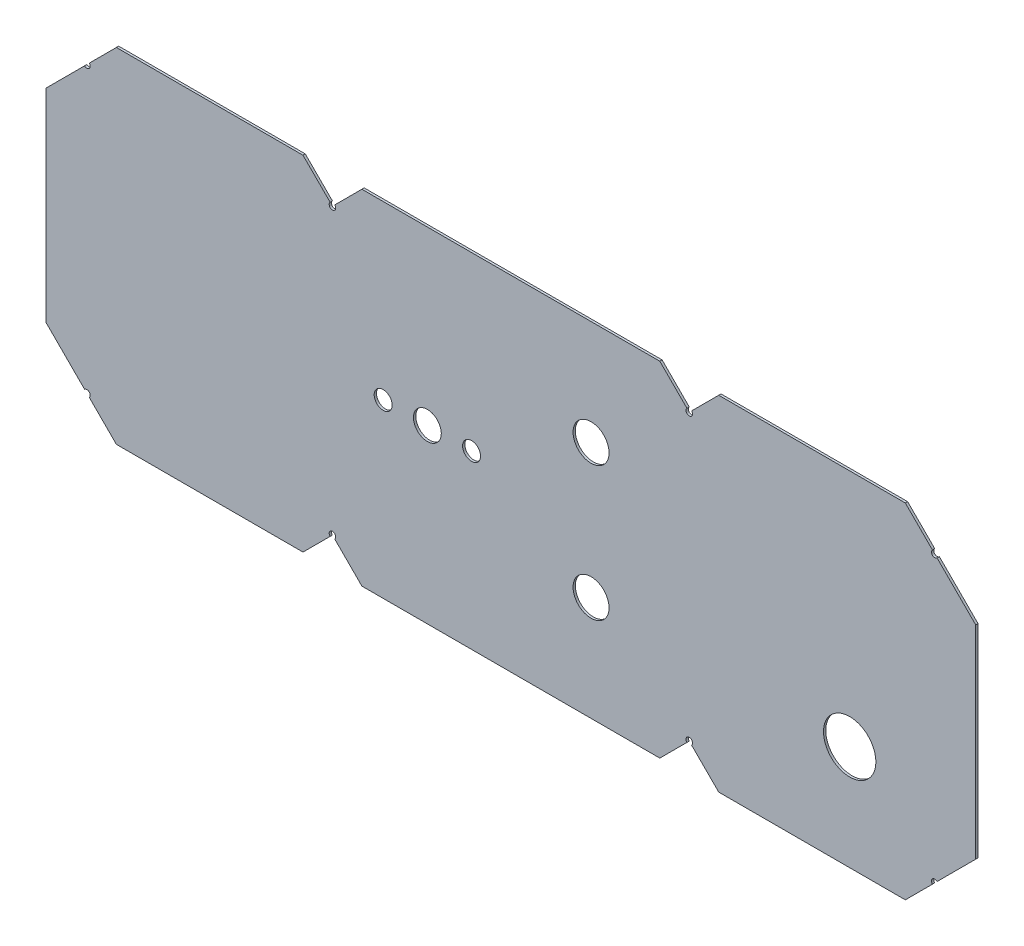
from build123d import *

# Parameters (mm, degrees)
IZIM1_R                     = 8
IZIM1_R_2                   = 2.75
IZIM1_R_3                   = 5.5
IZIM1_R_4                   = 4.25
Y_KSEKLIK_EKSTR_ZYON1_DEPTH = 0.7


with BuildPart() as part:
    # izim1 → Y_kseklik-Ekstr_zyon1 (new body)
    with BuildSketch(Plane.XY):
        with BuildLine():
            Line((10.439339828, 94.939339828), (10.792893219, 95.292893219))
            ThreePointArc((10.792893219, 95.292893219), (12.207106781, 95.292893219), (12.207106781, 96.707106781))
            Line((12.207106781, 96.707106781), (12.560660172, 97.060660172))
            Line((12.560660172, 97.060660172), (20.5, 105))
            Line((20.5, 105), (77.5, 105))
            Line((77.5, 105), (85.439339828, 97.060660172))
            Line((85.439339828, 97.060660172), (85.792893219, 96.707106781))
            ThreePointArc((85.792893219, 96.707106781), (86.5, 95), (87.207106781, 96.707106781))
            Line((87.207106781, 96.707106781), (87.560660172, 97.060660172))
            Line((87.560660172, 97.060660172), (95.5, 105))
            Line((95.5, 105), (132, 105))
            Line((132, 105), (150, 105))
            Line((150, 105), (186.5, 105))
            Line((186.5, 105), (194.439339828, 97.060660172))
            Line((194.439339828, 97.060660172), (194.792893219, 96.707106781))
            ThreePointArc((194.792893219, 96.707106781), (195.5, 95), (196.207106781, 96.707106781))
            Line((196.207106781, 96.707106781), (196.560660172, 97.060660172))
            Line((196.560660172, 97.060660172), (204.5, 105))
            Line((204.5, 105), (261.5, 105))
            Line((261.5, 105), (269.439339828, 97.060660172))
            Line((269.439339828, 97.060660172), (269.792893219, 96.707106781))
            ThreePointArc((269.792893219, 96.707106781), (269.792893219, 95.292893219), (271.207106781, 95.292893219))
            Line((271.207106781, 95.292893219), (271.560660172, 94.939339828))
            Line((271.560660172, 94.939339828), (282, 84.5))
            Line((282, 84.5), (283, 83.5))
            Line((283, 83.5), (283, 21.5))
            Line((283, 21.5), (282, 20.5))
            Line((282, 20.5), (271.560660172, 10.060660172))
            Line((271.560660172, 10.060660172), (271.207106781, 9.707106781))
            ThreePointArc((271.207106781, 9.707106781), (269.792893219, 9.707106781), (269.792893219, 8.292893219))
            Line((269.792893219, 8.292893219), (269.439339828, 7.939339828))
            Line((269.439339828, 7.939339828), (261.5, 0))
            Line((261.5, 0), (204.5, 0))
            Line((204.5, 0), (196.560660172, 7.939339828))
            Line((196.560660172, 7.939339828), (196.207106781, 8.292893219))
            ThreePointArc((196.207106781, 8.292893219), (195.5, 10), (194.792893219, 8.292893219))
            Line((194.792893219, 8.292893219), (194.439339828, 7.939339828))
            Line((194.439339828, 7.939339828), (186.5, 0))
            Line((186.5, 0), (150, 0))
            Line((150, 0), (132, 0))
            Line((132, 0), (95.5, 0))
            Line((95.5, 0), (87.560660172, 7.939339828))
            Line((87.560660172, 7.939339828), (87.207106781, 8.292893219))
            ThreePointArc((87.207106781, 8.292893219), (86.5, 10), (85.792893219, 8.292893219))
            Line((85.792893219, 8.292893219), (85.439339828, 7.939339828))
            Line((85.439339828, 7.939339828), (77.5, 0))
            Line((77.5, 0), (20.5, 0))
            Line((20.5, 0), (12.560660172, 7.939339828))
            Line((12.560660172, 7.939339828), (12.207106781, 8.292893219))
            ThreePointArc((12.207106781, 8.292893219), (12.207106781, 9.707106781), (10.792893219, 9.707106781))
            Line((10.792893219, 9.707106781), (10.439339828, 10.060660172))
            Line((10.439339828, 10.060660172), (0, 20.5))
            Line((0, 20.5), (-1, 21.5))
            Line((-1, 21.5), (-1, 83.5))
            Line((-1, 83.5), (0, 84.5))
            Line((0, 84.5), (10.439339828, 94.939339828))
        make_face()
        with Locations((244.5, 32)):
            Circle(IZIM1_R, mode=Mode.SUBTRACT)
        with Locations((102, 52.5)):
            Circle(IZIM1_R_2, mode=Mode.SUBTRACT)
        with Locations((165.5, 73)):
            Circle(IZIM1_R_3, mode=Mode.SUBTRACT)
        with Locations((165.5, 32)):
            Circle(IZIM1_R_3, mode=Mode.SUBTRACT)
        with Locations((129, 52.5)):
            Circle(IZIM1_R_2, mode=Mode.SUBTRACT)
        with Locations((115.5, 52.5)):
            Circle(IZIM1_R_4, mode=Mode.SUBTRACT)
    extrude(amount=Y_KSEKLIK_EKSTR_ZYON1_DEPTH)


solid = part.part
